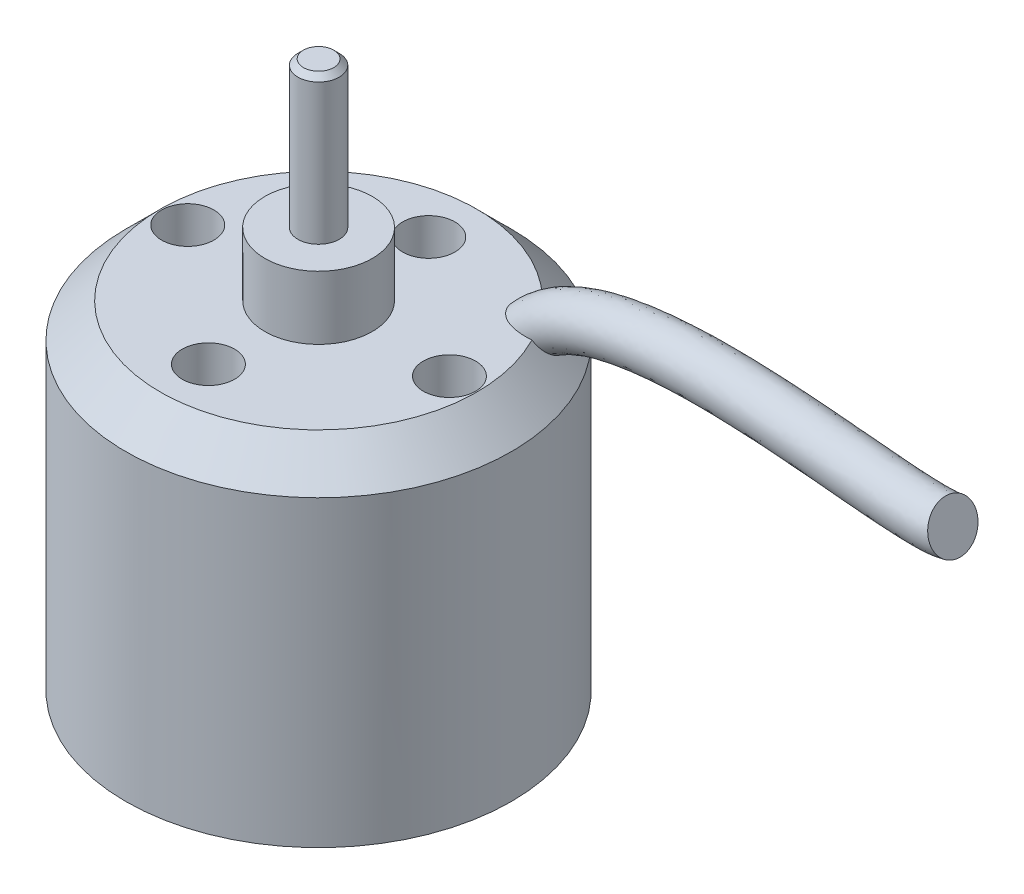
ISO-10303-21;
HEADER;
FILE_DESCRIPTION(('STEP AP214'),'2;1');
FILE_NAME('part.step','',(''),(''),'','','');
FILE_SCHEMA(('AUTOMOTIVE_DESIGN { 1 0 10303 214 1 1 1 1 }'));
ENDSEC;
DATA;
#1=APPLICATION_CONTEXT('core data for automotive mechanical design processes');
#2=APPLICATION_PROTOCOL_DEFINITION('international standard','automotive_design',2000,#1);
#3=PRODUCT_CONTEXT('',#1,'mechanical');
#4=PRODUCT('Part','Part','',(#3));
#5=PRODUCT_RELATED_PRODUCT_CATEGORY('part','',(#4));
#6=PRODUCT_DEFINITION_FORMATION('','',#4);
#7=PRODUCT_DEFINITION_CONTEXT('part definition',#1,'design');
#8=PRODUCT_DEFINITION('design','',#6,#7);
#9=PRODUCT_DEFINITION_SHAPE('','',#8);
#10=(LENGTH_UNIT() NAMED_UNIT(*) SI_UNIT(.MILLI.,.METRE.));
#11=(NAMED_UNIT(*) PLANE_ANGLE_UNIT() SI_UNIT($,.RADIAN.));
#12=(NAMED_UNIT(*) SI_UNIT($,.STERADIAN.) SOLID_ANGLE_UNIT());
#13=UNCERTAINTY_MEASURE_WITH_UNIT(LENGTH_MEASURE(1.E-05),#10,'distance_accuracy_value','');
#14=(GEOMETRIC_REPRESENTATION_CONTEXT(3) GLOBAL_UNCERTAINTY_ASSIGNED_CONTEXT((#13)) GLOBAL_UNIT_ASSIGNED_CONTEXT((#10,
#11,#12)) REPRESENTATION_CONTEXT('',''));
#15=CARTESIAN_POINT('',(0.,0.,0.));
#16=DIRECTION('',(0.,0.,1.));
#17=DIRECTION('',(1.,0.,0.));
#18=AXIS2_PLACEMENT_3D('',#15,#16,#17);
#19=CARTESIAN_POINT('',(0.,27.,0.));
#20=DIRECTION('',(0.,-1.,0.));
#21=DIRECTION('',(1.,0.,0.));
#22=AXIS2_PLACEMENT_3D('',#19,#20,#21);
#23=CONICAL_SURFACE('',#22,14.,0.785398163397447);
#24=CARTESIAN_POINT('',(0.,27.,0.));
#25=DIRECTION('',(0.,1.,0.));
#26=DIRECTION('',(-1.,0.,0.));
#27=AXIS2_PLACEMENT_3D('',#24,#25,#26);
#28=CIRCLE('',#27,14.);
#29=CARTESIAN_POINT('',(-14.,27.,0.));
#30=VERTEX_POINT('',#29);
#31=EDGE_CURVE('E74',#30,#30,#28,.T.);
#32=ORIENTED_EDGE('',*,*,#31,.T.);
#33=EDGE_LOOP('',(#32));
#34=FACE_BOUND('',#33,.T.);
#35=CARTESIAN_POINT('',(10.2216471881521,29.5,-5.26952832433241));
#36=CARTESIAN_POINT('',(10.254055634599,29.4681281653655,-5.27621630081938));
#37=CARTESIAN_POINT('',(10.2858422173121,29.4360112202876,-5.2846293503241));
#38=CARTESIAN_POINT('',(10.3479813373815,29.3714681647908,-5.30490973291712));
#39=CARTESIAN_POINT('',(10.3783335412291,29.3390419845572,-5.31677786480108));
#40=CARTESIAN_POINT('',(10.4669311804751,29.2415932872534,-5.35756541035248));
#41=CARTESIAN_POINT('',(10.5227172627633,29.1764009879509,-5.39166789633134));
#42=CARTESIAN_POINT('',(10.625863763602,29.0474329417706,-5.47311896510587));
#43=CARTESIAN_POINT('',(10.6732084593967,28.9836600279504,-5.52049185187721));
#44=CARTESIAN_POINT('',(10.7576410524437,28.8595143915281,-5.62719451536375));
#45=CARTESIAN_POINT('',(10.7947392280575,28.7991383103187,-5.6865122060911));
#46=CARTESIAN_POINT('',(10.8564687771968,28.6850932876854,-5.81340494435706));
#47=CARTESIAN_POINT('',(10.8814299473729,28.6312807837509,-5.88069125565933));
#48=CARTESIAN_POINT('',(10.9197244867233,28.5296232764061,-6.02268441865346));
#49=CARTESIAN_POINT('',(10.9330543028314,28.4817801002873,-6.09739353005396));
#50=CARTESIAN_POINT('',(10.9479661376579,28.3926017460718,-6.25240938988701));
#51=CARTESIAN_POINT('',(10.9494611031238,28.3513169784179,-6.33275324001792));
#52=CARTESIAN_POINT('',(10.9408725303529,28.2760957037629,-6.49617815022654));
#53=CARTESIAN_POINT('',(10.930786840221,28.2421605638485,-6.57925971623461));
#54=CARTESIAN_POINT('',(10.8985104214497,28.1791199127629,-6.75313379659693));
#55=CARTESIAN_POINT('',(10.8753672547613,28.150666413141,-6.84398370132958));
#56=CARTESIAN_POINT('',(10.8176126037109,28.102143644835,-7.02441256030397));
#57=CARTESIAN_POINT('',(10.7829772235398,28.082092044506,-7.11398845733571));
#58=CARTESIAN_POINT('',(10.6977206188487,28.0476710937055,-7.30297956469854));
#59=CARTESIAN_POINT('',(10.6454969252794,28.0345722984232,-7.40190270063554));
#60=CARTESIAN_POINT('',(10.5296429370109,28.0183875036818,-7.59350815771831));
#61=CARTESIAN_POINT('',(10.466021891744,28.0152934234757,-7.6861954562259));
#62=CARTESIAN_POINT('',(10.3189588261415,28.01895360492,-7.87674650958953));
#63=CARTESIAN_POINT('',(10.2339797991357,28.0272057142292,-7.97340241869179));
#64=CARTESIAN_POINT('',(10.0532371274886,28.0562370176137,-8.1541135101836));
#65=CARTESIAN_POINT('',(9.95746289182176,28.0770286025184,-8.23815612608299));
#66=CARTESIAN_POINT('',(9.75364891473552,28.1326217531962,-8.39356736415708));
#67=CARTESIAN_POINT('',(9.64528157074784,28.167925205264,-8.46433373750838));
#68=CARTESIAN_POINT('',(9.42291955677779,28.2532700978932,-8.58497580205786));
#69=CARTESIAN_POINT('',(9.30893871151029,28.3032767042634,-8.63490020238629));
#70=CARTESIAN_POINT('',(9.11470756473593,28.40103247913,-8.69836795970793));
#71=CARTESIAN_POINT('',(9.03460573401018,28.4449507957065,-8.71833416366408));
#72=CARTESIAN_POINT('',(8.87637867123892,28.5399079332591,-8.74459601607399));
#73=CARTESIAN_POINT('',(8.79825204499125,28.5909415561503,-8.75090158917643));
#74=CARTESIAN_POINT('',(8.64629398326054,28.6996532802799,-8.74888462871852));
#75=CARTESIAN_POINT('',(8.57248679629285,28.7573643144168,-8.74048643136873));
#76=CARTESIAN_POINT('',(8.43254672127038,28.8777945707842,-8.70870603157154));
#77=CARTESIAN_POINT('',(8.36641231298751,28.940512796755,-8.68532680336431));
#78=CARTESIAN_POINT('',(8.24988976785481,29.0631934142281,-8.62711453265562));
#79=CARTESIAN_POINT('',(8.19862306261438,29.1229021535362,-8.59349001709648));
#80=CARTESIAN_POINT('',(8.10603599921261,29.2430978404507,-8.51569024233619));
#81=CARTESIAN_POINT('',(8.06470713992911,29.3035840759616,-8.47152406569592));
#82=CARTESIAN_POINT('',(8.01498612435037,29.3865169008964,-8.40434339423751));
#83=CARTESIAN_POINT('',(8.0020083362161,29.4094016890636,-8.38509719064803));
#84=CARTESIAN_POINT('',(7.97765313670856,29.4549037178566,-8.34543727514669));
#85=CARTESIAN_POINT('',(7.9662721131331,29.4775214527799,-8.32502635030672));
#86=CARTESIAN_POINT('',(7.95567229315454,29.4999999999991,-8.30405192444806));
#87=B_SPLINE_CURVE_WITH_KNOTS('',3,(#35,#36,#37,#38,#39,#40,#41,#42,#43,#44,#45,#46,#47,#48,#49,
#50,#51,#52,#53,#54,#55,#56,#57,#58,#59,#60,#61,#62,#63,#64,#65,#66,#67,#68,#69,#70,#71,#72,#73,
#74,#75,#76,#77,#78,#79,#80,#81,#82,#83,#84,#85,#86),.UNSPECIFIED.,.F.,.F.,(4,2,2,2,2,2,2,2,2,2,
2,2,2,2,2,2,2,2,2,2,2,2,2,2,2,4),(0.,0.137757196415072,0.275546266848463,0.551126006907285,
0.827213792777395,1.10302361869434,1.3708494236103,1.63875701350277,1.90863342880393,
2.1785600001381,2.47133629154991,2.7647252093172,3.10129219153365,3.4375872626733,
3.82279485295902,4.20838370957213,4.60861036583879,5.00789635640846,5.28728883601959,
5.56647826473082,5.8471085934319,6.12768322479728,6.38321575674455,6.63852891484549,
6.73627327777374,6.83379282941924),.UNSPECIFIED.);
#88=CARTESIAN_POINT('',(10.2216471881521,29.5,-5.26952832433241));
#89=VERTEX_POINT('',#88);
#90=CARTESIAN_POINT('',(7.95567229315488,29.5,-8.30405192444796));
#91=VERTEX_POINT('',#90);
#92=EDGE_CURVE('E77',#89,#91,#87,.T.);
#93=ORIENTED_EDGE('',*,*,#92,.F.);
#94=CARTESIAN_POINT('',(0.,29.5,0.));
#95=DIRECTION('',(0.,1.,0.));
#96=DIRECTION('',(-1.,0.,0.));
#97=AXIS2_PLACEMENT_3D('',#94,#95,#96);
#98=CIRCLE('',#97,11.5);
#99=EDGE_CURVE('E69',#91,#89,#98,.T.);
#100=ORIENTED_EDGE('',*,*,#99,.F.);
#101=EDGE_LOOP('',(#93,#100));
#102=FACE_BOUND('',#101,.T.);
#103=ADVANCED_FACE('F50',(#34,#102),#23,.T.);
#104=CARTESIAN_POINT('',(11.5,29.5,0.));
#105=DIRECTION('',(0.,-1.,0.));
#106=DIRECTION('',(1.,0.,0.));
#107=AXIS2_PLACEMENT_3D('',#104,#105,#106);
#108=PLANE('',#107);
#109=CARTESIAN_POINT('',(0.,29.5,0.));
#110=DIRECTION('',(0.,1.,0.));
#111=DIRECTION('',(-1.,0.,0.));
#112=AXIS2_PLACEMENT_3D('',#109,#110,#111);
#113=CIRCLE('',#112,3.9);
#114=CARTESIAN_POINT('',(-3.9,29.5,0.));
#115=VERTEX_POINT('',#114);
#116=EDGE_CURVE('E75',#115,#115,#113,.T.);
#117=ORIENTED_EDGE('',*,*,#116,.F.);
#118=EDGE_LOOP('',(#117));
#119=FACE_BOUND('',#118,.T.);
#120=CARTESIAN_POINT('',(9.5,29.5,0.));
#121=DIRECTION('',(0.,1.,0.));
#122=DIRECTION('',(-1.,0.,0.));
#123=AXIS2_PLACEMENT_3D('',#120,#121,#122);
#124=CIRCLE('',#123,1.9);
#125=CARTESIAN_POINT('',(7.6,29.5,0.));
#126=VERTEX_POINT('',#125);
#127=EDGE_CURVE('E134',#126,#126,#124,.T.);
#128=ORIENTED_EDGE('',*,*,#127,.F.);
#129=EDGE_LOOP('',(#128));
#130=FACE_BOUND('',#129,.T.);
#131=CARTESIAN_POINT('',(-9.5,29.5,0.));
#132=DIRECTION('',(0.,1.,0.));
#133=DIRECTION('',(-1.,0.,0.));
#134=AXIS2_PLACEMENT_3D('',#131,#132,#133);
#135=CIRCLE('',#134,1.9);
#136=CARTESIAN_POINT('',(-11.4,29.5,0.));
#137=VERTEX_POINT('',#136);
#138=EDGE_CURVE('E128',#137,#137,#135,.T.);
#139=ORIENTED_EDGE('',*,*,#138,.F.);
#140=EDGE_LOOP('',(#139));
#141=FACE_BOUND('',#140,.T.);
#142=CARTESIAN_POINT('',(0.,29.5,8.));
#143=DIRECTION('',(0.,1.,0.));
#144=DIRECTION('',(-1.,0.,0.));
#145=AXIS2_PLACEMENT_3D('',#142,#143,#144);
#146=CIRCLE('',#145,1.9);
#147=CARTESIAN_POINT('',(-1.9,29.5,8.));
#148=VERTEX_POINT('',#147);
#149=EDGE_CURVE('E122',#148,#148,#146,.T.);
#150=ORIENTED_EDGE('',*,*,#149,.F.);
#151=EDGE_LOOP('',(#150));
#152=FACE_BOUND('',#151,.T.);
#153=CARTESIAN_POINT('',(0.,29.5,-8.));
#154=DIRECTION('',(0.,1.,0.));
#155=DIRECTION('',(1.,0.,0.));
#156=AXIS2_PLACEMENT_3D('',#153,#154,#155);
#157=CIRCLE('',#156,1.9);
#158=CARTESIAN_POINT('',(1.9,29.5,-8.));
#159=VERTEX_POINT('',#158);
#160=EDGE_CURVE('E79',#159,#159,#157,.T.);
#161=ORIENTED_EDGE('',*,*,#160,.F.);
#162=EDGE_LOOP('',(#161));
#163=FACE_BOUND('',#162,.T.);
#164=CARTESIAN_POINT('',(11.638,29.5,-8.46599852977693));
#165=CARTESIAN_POINT('',(11.574996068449,29.5,-8.48386139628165));
#166=CARTESIAN_POINT('',(11.5117883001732,29.5,-8.50099694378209));
#167=CARTESIAN_POINT('',(11.384982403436,29.5,-8.53377258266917));
#168=CARTESIAN_POINT('',(11.3213842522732,29.5,-8.54941258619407));
#169=CARTESIAN_POINT('',(11.1291649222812,29.5,-8.59422936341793));
#170=CARTESIAN_POINT('',(10.999985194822,29.5,-8.6210561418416));
#171=CARTESIAN_POINT('',(10.7400381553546,29.5,-8.66792682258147));
#172=CARTESIAN_POINT('',(10.6092675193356,29.5,-8.68795237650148));
#173=CARTESIAN_POINT('',(10.3445688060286,29.5,-8.72050408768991));
#174=CARTESIAN_POINT('',(10.2106243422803,29.5,-8.73290029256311));
#175=CARTESIAN_POINT('',(9.94246969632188,29.5,-8.74841012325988));
#176=CARTESIAN_POINT('',(9.80826073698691,29.5,-8.75154400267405));
#177=CARTESIAN_POINT('',(9.54020598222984,29.5,-8.74702728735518));
#178=CARTESIAN_POINT('',(9.40635998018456,29.5,-8.7393970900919));
#179=CARTESIAN_POINT('',(9.20520048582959,29.5,-8.71832393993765));
#180=CARTESIAN_POINT('',(9.13738729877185,29.5,-8.70955400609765));
#181=CARTESIAN_POINT('',(9.00231903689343,29.5,-8.6884323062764));
#182=CARTESIAN_POINT('',(8.93506400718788,29.5,-8.67608025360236));
#183=CARTESIAN_POINT('',(8.73477090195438,29.5,-8.63325111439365));
#184=CARTESIAN_POINT('',(8.60288844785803,29.4999999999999,-8.59697088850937));
#185=CARTESIAN_POINT('',(8.34389905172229,29.5000000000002,-8.50592981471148));
#186=CARTESIAN_POINT('',(8.21686070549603,29.5000000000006,-8.45096982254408));
#187=CARTESIAN_POINT('',(7.97391600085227,29.4999999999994,-8.32015874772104));
#188=CARTESIAN_POINT('',(7.85798850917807,29.4999999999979,-8.2443484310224));
#189=CARTESIAN_POINT('',(7.67911440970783,29.4999999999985,-8.09883224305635));
#190=CARTESIAN_POINT('',(7.61122386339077,29.4999999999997,-8.03520753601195));
#191=CARTESIAN_POINT('',(7.48633949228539,29.5000000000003,-7.89793014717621));
#192=CARTESIAN_POINT('',(7.42934177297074,29.4999999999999,-7.82428106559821));
#193=CARTESIAN_POINT('',(7.32886127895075,29.4999999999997,-7.6671684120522));
#194=CARTESIAN_POINT('',(7.28551204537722,29.4999999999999,-7.58361824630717));
#195=CARTESIAN_POINT('',(7.21624236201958,29.5000000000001,-7.40956415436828));
#196=CARTESIAN_POINT('',(7.19030161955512,29.5,-7.31906846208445));
#197=CARTESIAN_POINT('',(7.16032412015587,29.5,-7.14785770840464));
#198=CARTESIAN_POINT('',(7.15368678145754,29.5,-7.06759320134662));
#199=CARTESIAN_POINT('',(7.15523805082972,29.5,-6.90721984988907));
#200=CARTESIAN_POINT('',(7.16342106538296,29.5,-6.82711095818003));
#201=CARTESIAN_POINT('',(7.19283412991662,29.5,-6.67586147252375));
#202=CARTESIAN_POINT('',(7.21299704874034,29.5,-6.60450865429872));
#203=CARTESIAN_POINT('',(7.26432307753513,29.5,-6.46590898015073));
#204=CARTESIAN_POINT('',(7.29548679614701,29.5,-6.39866235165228));
#205=CARTESIAN_POINT('',(7.36961961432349,29.5,-6.26546017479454));
#206=CARTESIAN_POINT('',(7.41320738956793,29.5,-6.19985116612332));
#207=CARTESIAN_POINT('',(7.50926842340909,29.5,-6.07553091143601));
#208=CARTESIAN_POINT('',(7.56174721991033,29.5,-6.01682400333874));
#209=CARTESIAN_POINT('',(7.70080102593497,29.5,-5.88012943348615));
#210=CARTESIAN_POINT('',(7.79163148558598,29.5,-5.80645766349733));
#211=CARTESIAN_POINT('',(7.98396175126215,29.5,-5.67472341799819));
#212=CARTESIAN_POINT('',(8.08548292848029,29.5,-5.6166930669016));
#213=CARTESIAN_POINT('',(8.34126095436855,29.5,-5.49292833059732));
#214=CARTESIAN_POINT('',(8.49921015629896,29.5,-5.43486827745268));
#215=CARTESIAN_POINT('',(8.82211512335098,29.5,-5.34399354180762));
#216=CARTESIAN_POINT('',(8.98708373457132,29.5,-5.31122744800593));
#217=CARTESIAN_POINT('',(9.2907973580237,29.5,-5.2703880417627));
#218=CARTESIAN_POINT('',(9.42913138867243,29.5,-5.25901907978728));
#219=CARTESIAN_POINT('',(9.70632238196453,29.5,-5.2483007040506));
#220=CARTESIAN_POINT('',(9.84517965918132,29.5,-5.24896031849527));
#221=CARTESIAN_POINT('',(10.12273287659,29.5,-5.2605088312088));
#222=CARTESIAN_POINT('',(10.2614277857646,29.5,-5.27142028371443));
#223=CARTESIAN_POINT('',(10.5377644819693,29.5,-5.30205332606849));
#224=CARTESIAN_POINT('',(10.6754066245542,29.5,-5.3217717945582));
#225=CARTESIAN_POINT('',(10.9520156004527,29.5,-5.3693908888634));
#226=CARTESIAN_POINT('',(11.0909561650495,29.5,-5.3974431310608));
#227=CARTESIAN_POINT('',(11.2976455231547,29.5,-5.44484579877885));
#228=CARTESIAN_POINT('',(11.3660330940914,29.5,-5.46147079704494));
#229=CARTESIAN_POINT('',(11.502358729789,29.5,-5.49645143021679));
#230=CARTESIAN_POINT('',(11.570296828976,29.5,-5.51480693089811));
#231=CARTESIAN_POINT('',(11.638,29.5,-5.53400147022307));
#232=B_SPLINE_CURVE_WITH_KNOTS('',3,(#164,#165,#166,#167,#168,#169,#170,#171,#172,#173,#174,
#175,#176,#177,#178,#179,#180,#181,#182,#183,#184,#185,#186,#187,#188,#189,#190,#191,#192,#193,
#194,#195,#196,#197,#198,#199,#200,#201,#202,#203,#204,#205,#206,#207,#208,#209,#210,#211,#212,
#213,#214,#215,#216,#217,#218,#219,#220,#221,#222,#223,#224,#225,#226,#227,#228,#229,#230,#231),
.UNSPECIFIED.,.F.,.F.,(4,2,2,2,2,2,2,2,2,2,2,2,2,2,2,2,2,2,2,2,2,2,2,2,2,2,2,2,2,2,2,2,2,4),(0.,
0.196452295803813,0.392916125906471,0.788543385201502,1.18522964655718,1.5884981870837,
1.99088426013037,2.39250885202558,2.59755629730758,2.8026201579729,3.21179964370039,
3.62548582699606,4.03836886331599,4.3165149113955,4.59456132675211,4.87524928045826,
5.15560947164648,5.39590188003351,5.63610361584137,5.85757503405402,6.07905870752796,
6.31445723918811,6.55000293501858,6.89889324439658,7.2484947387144,7.75053840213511,
8.25354408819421,8.6693618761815,9.08549177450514,9.50253931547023,9.91943916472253,
10.3444439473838,10.5555631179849,10.7666659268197),.UNSPECIFIED.);
#233=EDGE_CURVE('E12',#91,#89,#232,.T.);
#234=ORIENTED_EDGE('',*,*,#233,.F.);
#235=ORIENTED_EDGE('',*,*,#99,.T.);
#236=EDGE_LOOP('',(#234,#235));
#237=FACE_BOUND('',#236,.T.);
#238=ADVANCED_FACE('F71',(#119,#130,#141,#152,#163,#237),#108,.F.);
#239=CARTESIAN_POINT('',(0.,44.3,0.));
#240=DIRECTION('',(0.,-1.,0.));
#241=DIRECTION('',(1.,0.,0.));
#242=AXIS2_PLACEMENT_3D('',#239,#240,#241);
#243=CONICAL_SURFACE('',#242,1.50000000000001,0.785398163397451);
#244=CARTESIAN_POINT('',(0.,44.7,0.));
#245=DIRECTION('',(0.,1.,0.));
#246=DIRECTION('',(-1.,0.,0.));
#247=AXIS2_PLACEMENT_3D('',#244,#245,#246);
#248=CIRCLE('',#247,1.10000000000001);
#249=CARTESIAN_POINT('',(-1.1,44.7,0.));
#250=VERTEX_POINT('',#249);
#251=EDGE_CURVE('E63',#250,#250,#248,.T.);
#252=ORIENTED_EDGE('',*,*,#251,.F.);
#253=EDGE_LOOP('',(#252));
#254=FACE_BOUND('',#253,.T.);
#255=CARTESIAN_POINT('',(0.,44.3,0.));
#256=DIRECTION('',(0.,1.,0.));
#257=DIRECTION('',(-1.,0.,0.));
#258=AXIS2_PLACEMENT_3D('',#255,#256,#257);
#259=CIRCLE('',#258,1.50000000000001);
#260=CARTESIAN_POINT('',(-1.5,44.3,0.));
#261=VERTEX_POINT('',#260);
#262=EDGE_CURVE('E140',#261,#261,#259,.T.);
#263=ORIENTED_EDGE('',*,*,#262,.T.);
#264=EDGE_LOOP('',(#263));
#265=FACE_BOUND('',#264,.T.);
#266=ADVANCED_FACE('F52',(#254,#265),#243,.T.);
#267=CARTESIAN_POINT('',(1.10000000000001,44.7,0.));
#268=DIRECTION('',(0.,-1.,0.));
#269=DIRECTION('',(1.,0.,0.));
#270=AXIS2_PLACEMENT_3D('',#267,#268,#269);
#271=PLANE('',#270);
#272=ORIENTED_EDGE('',*,*,#251,.T.);
#273=EDGE_LOOP('',(#272));
#274=FACE_BOUND('',#273,.T.);
#275=ADVANCED_FACE('F171',(#274),#271,.F.);
#276=CARTESIAN_POINT('',(1.50000000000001,0.,0.));
#277=DIRECTION('',(0.,1.,0.));
#278=DIRECTION('',(-1.,0.,0.));
#279=AXIS2_PLACEMENT_3D('',#276,#277,#278);
#280=PLANE('',#279);
#281=CARTESIAN_POINT('',(0.,0.,0.));
#282=DIRECTION('',(0.,1.,0.));
#283=DIRECTION('',(-1.,0.,0.));
#284=AXIS2_PLACEMENT_3D('',#281,#282,#283);
#285=CIRCLE('',#284,1.50000000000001);
#286=CARTESIAN_POINT('',(-1.50000000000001,0.,0.));
#287=VERTEX_POINT('',#286);
#288=EDGE_CURVE('E166',#287,#287,#285,.T.);
#289=ORIENTED_EDGE('',*,*,#288,.F.);
#290=EDGE_LOOP('',(#289));
#291=FACE_BOUND('',#290,.T.);
#292=ADVANCED_FACE('F361',(#291),#280,.F.);
#293=CARTESIAN_POINT('',(0.,44.7,0.));
#294=DIRECTION('',(0.,1.,0.));
#295=DIRECTION('',(-1.,0.,0.));
#296=AXIS2_PLACEMENT_3D('',#293,#294,#295);
#297=CYLINDRICAL_SURFACE('',#296,1.50000000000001);
#298=CARTESIAN_POINT('',(0.,0.399999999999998,0.));
#299=DIRECTION('',(0.,1.,0.));
#300=DIRECTION('',(-1.,0.,0.));
#301=AXIS2_PLACEMENT_3D('',#298,#299,#300);
#302=CIRCLE('',#301,1.50000000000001);
#303=CARTESIAN_POINT('',(-1.5,0.399999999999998,0.));
#304=VERTEX_POINT('',#303);
#305=EDGE_CURVE('E163',#304,#304,#302,.T.);
#306=ORIENTED_EDGE('',*,*,#305,.F.);
#307=EDGE_LOOP('',(#306));
#308=FACE_BOUND('',#307,.T.);
#309=ORIENTED_EDGE('',*,*,#288,.T.);
#310=EDGE_LOOP('',(#309));
#311=FACE_BOUND('',#310,.T.);
#312=ADVANCED_FACE('F351',(#308,#311),#297,.T.);
#313=CARTESIAN_POINT('',(4.00000000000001,0.4,0.));
#314=DIRECTION('',(0.,1.,0.));
#315=DIRECTION('',(-1.,0.,0.));
#316=AXIS2_PLACEMENT_3D('',#313,#314,#315);
#317=PLANE('',#316);
#318=CARTESIAN_POINT('',(0.,0.399999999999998,0.));
#319=DIRECTION('',(0.,1.,0.));
#320=DIRECTION('',(-1.,0.,0.));
#321=AXIS2_PLACEMENT_3D('',#318,#319,#320);
#322=CIRCLE('',#321,4.00000000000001);
#323=CARTESIAN_POINT('',(-4.00000000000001,0.399999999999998,0.));
#324=VERTEX_POINT('',#323);
#325=EDGE_CURVE('E160',#324,#324,#322,.T.);
#326=ORIENTED_EDGE('',*,*,#325,.F.);
#327=EDGE_LOOP('',(#326));
#328=FACE_BOUND('',#327,.T.);
#329=ORIENTED_EDGE('',*,*,#305,.T.);
#330=EDGE_LOOP('',(#329));
#331=FACE_BOUND('',#330,.T.);
#332=ADVANCED_FACE('F343',(#328,#331),#317,.F.);
#333=CARTESIAN_POINT('',(0.,44.7,0.));
#334=DIRECTION('',(0.,1.,0.));
#335=DIRECTION('',(-1.,0.,0.));
#336=AXIS2_PLACEMENT_3D('',#333,#334,#335);
#337=CYLINDRICAL_SURFACE('',#336,4.00000000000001);
#338=CARTESIAN_POINT('',(0.,5.,0.));
#339=DIRECTION('',(0.,1.,0.));
#340=DIRECTION('',(-1.,0.,0.));
#341=AXIS2_PLACEMENT_3D('',#338,#339,#340);
#342=CIRCLE('',#341,4.00000000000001);
#343=CARTESIAN_POINT('',(-4.00000000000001,5.,0.));
#344=VERTEX_POINT('',#343);
#345=EDGE_CURVE('E157',#344,#344,#342,.T.);
#346=ORIENTED_EDGE('',*,*,#345,.F.);
#347=EDGE_LOOP('',(#346));
#348=FACE_BOUND('',#347,.T.);
#349=ORIENTED_EDGE('',*,*,#325,.T.);
#350=EDGE_LOOP('',(#349));
#351=FACE_BOUND('',#350,.T.);
#352=ADVANCED_FACE('F288',(#348,#351),#337,.T.);
#353=CARTESIAN_POINT('',(4.00000000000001,5.,0.));
#354=DIRECTION('',(0.,1.,0.));
#355=DIRECTION('',(-1.,0.,0.));
#356=AXIS2_PLACEMENT_3D('',#353,#354,#355);
#357=PLANE('',#356);
#358=ORIENTED_EDGE('',*,*,#345,.T.);
#359=EDGE_LOOP('',(#358));
#360=FACE_BOUND('',#359,.T.);
#361=CARTESIAN_POINT('',(0.,5.,0.));
#362=DIRECTION('',(0.,1.,0.));
#363=DIRECTION('',(-1.,0.,0.));
#364=AXIS2_PLACEMENT_3D('',#361,#362,#363);
#365=CIRCLE('',#364,14.);
#366=CARTESIAN_POINT('',(-14.,5.,0.));
#367=VERTEX_POINT('',#366);
#368=EDGE_CURVE('E154',#367,#367,#365,.T.);
#369=ORIENTED_EDGE('',*,*,#368,.F.);
#370=EDGE_LOOP('',(#369));
#371=FACE_BOUND('',#370,.T.);
#372=ADVANCED_FACE('F284',(#360,#371),#357,.F.);
#373=CARTESIAN_POINT('',(0.,44.7,0.));
#374=DIRECTION('',(0.,1.,0.));
#375=DIRECTION('',(-1.,0.,0.));
#376=AXIS2_PLACEMENT_3D('',#373,#374,#375);
#377=CYLINDRICAL_SURFACE('',#376,14.);
#378=ORIENTED_EDGE('',*,*,#31,.F.);
#379=EDGE_LOOP('',(#378));
#380=FACE_BOUND('',#379,.T.);
#381=ORIENTED_EDGE('',*,*,#368,.T.);
#382=EDGE_LOOP('',(#381));
#383=FACE_BOUND('',#382,.T.);
#384=ADVANCED_FACE('F112',(#380,#383),#377,.T.);
#385=CARTESIAN_POINT('',(0.,44.7,0.));
#386=DIRECTION('',(0.,1.,0.));
#387=DIRECTION('',(-1.,0.,0.));
#388=AXIS2_PLACEMENT_3D('',#385,#386,#387);
#389=CYLINDRICAL_SURFACE('',#388,3.9);
#390=CARTESIAN_POINT('',(0.,34.1,0.));
#391=DIRECTION('',(0.,1.,0.));
#392=DIRECTION('',(-1.,0.,0.));
#393=AXIS2_PLACEMENT_3D('',#390,#391,#392);
#394=CIRCLE('',#393,3.9);
#395=CARTESIAN_POINT('',(-3.9,34.1,0.));
#396=VERTEX_POINT('',#395);
#397=EDGE_CURVE('E148',#396,#396,#394,.T.);
#398=ORIENTED_EDGE('',*,*,#397,.F.);
#399=EDGE_LOOP('',(#398));
#400=FACE_BOUND('',#399,.T.);
#401=ORIENTED_EDGE('',*,*,#116,.T.);
#402=EDGE_LOOP('',(#401));
#403=FACE_BOUND('',#402,.T.);
#404=ADVANCED_FACE('F187',(#400,#403),#389,.T.);
#405=CARTESIAN_POINT('',(3.9,34.1,0.));
#406=DIRECTION('',(0.,-1.,0.));
#407=DIRECTION('',(1.,0.,0.));
#408=AXIS2_PLACEMENT_3D('',#405,#406,#407);
#409=PLANE('',#408);
#410=CARTESIAN_POINT('',(0.,34.1,0.));
#411=DIRECTION('',(0.,1.,0.));
#412=DIRECTION('',(-1.,0.,0.));
#413=AXIS2_PLACEMENT_3D('',#410,#411,#412);
#414=CIRCLE('',#413,1.50000000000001);
#415=CARTESIAN_POINT('',(-1.5,34.1,0.));
#416=VERTEX_POINT('',#415);
#417=EDGE_CURVE('E145',#416,#416,#414,.T.);
#418=ORIENTED_EDGE('',*,*,#417,.F.);
#419=EDGE_LOOP('',(#418));
#420=FACE_BOUND('',#419,.T.);
#421=ORIENTED_EDGE('',*,*,#397,.T.);
#422=EDGE_LOOP('',(#421));
#423=FACE_BOUND('',#422,.T.);
#424=ADVANCED_FACE('F181',(#420,#423),#409,.F.);
#425=CARTESIAN_POINT('',(0.,44.7,0.));
#426=DIRECTION('',(0.,1.,0.));
#427=DIRECTION('',(-1.,0.,0.));
#428=AXIS2_PLACEMENT_3D('',#425,#426,#427);
#429=CYLINDRICAL_SURFACE('',#428,1.50000000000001);
#430=ORIENTED_EDGE('',*,*,#262,.F.);
#431=EDGE_LOOP('',(#430));
#432=FACE_BOUND('',#431,.T.);
#433=ORIENTED_EDGE('',*,*,#417,.T.);
#434=EDGE_LOOP('',(#433));
#435=FACE_BOUND('',#434,.T.);
#436=ADVANCED_FACE('F177',(#432,#435),#429,.T.);
#437=CARTESIAN_POINT('',(9.5,19.5,0.));
#438=DIRECTION('',(0.,1.,0.));
#439=DIRECTION('',(-1.,0.,0.));
#440=AXIS2_PLACEMENT_3D('',#437,#438,#439);
#441=CYLINDRICAL_SURFACE('',#440,1.9);
#442=CARTESIAN_POINT('',(9.5,19.5,0.));
#443=DIRECTION('',(0.,1.,0.));
#444=DIRECTION('',(-1.,0.,0.));
#445=AXIS2_PLACEMENT_3D('',#442,#443,#444);
#446=CIRCLE('',#445,1.9);
#447=CARTESIAN_POINT('',(7.6,19.5,0.));
#448=VERTEX_POINT('',#447);
#449=EDGE_CURVE('E137',#448,#448,#446,.T.);
#450=ORIENTED_EDGE('',*,*,#449,.F.);
#451=EDGE_LOOP('',(#450));
#452=FACE_BOUND('',#451,.T.);
#453=ORIENTED_EDGE('',*,*,#127,.T.);
#454=EDGE_LOOP('',(#453));
#455=FACE_BOUND('',#454,.T.);
#456=ADVANCED_FACE('F180',(#452,#455),#441,.F.);
#457=CARTESIAN_POINT('',(9.5,19.5,0.));
#458=DIRECTION('',(0.,1.,0.));
#459=DIRECTION('',(-1.,0.,0.));
#460=AXIS2_PLACEMENT_3D('',#457,#458,#459);
#461=PLANE('',#460);
#462=ORIENTED_EDGE('',*,*,#449,.T.);
#463=EDGE_LOOP('',(#462));
#464=FACE_BOUND('',#463,.T.);
#465=ADVANCED_FACE('F225',(#464),#461,.T.);
#466=CARTESIAN_POINT('',(-9.5,19.5,0.));
#467=DIRECTION('',(0.,1.,0.));
#468=DIRECTION('',(-1.,0.,0.));
#469=AXIS2_PLACEMENT_3D('',#466,#467,#468);
#470=CYLINDRICAL_SURFACE('',#469,1.9);
#471=CARTESIAN_POINT('',(-9.5,19.5,0.));
#472=DIRECTION('',(0.,1.,0.));
#473=DIRECTION('',(-1.,0.,0.));
#474=AXIS2_PLACEMENT_3D('',#471,#472,#473);
#475=CIRCLE('',#474,1.9);
#476=CARTESIAN_POINT('',(-11.4,19.5,0.));
#477=VERTEX_POINT('',#476);
#478=EDGE_CURVE('E131',#477,#477,#475,.T.);
#479=ORIENTED_EDGE('',*,*,#478,.F.);
#480=EDGE_LOOP('',(#479));
#481=FACE_BOUND('',#480,.T.);
#482=ORIENTED_EDGE('',*,*,#138,.T.);
#483=EDGE_LOOP('',(#482));
#484=FACE_BOUND('',#483,.T.);
#485=ADVANCED_FACE('F221',(#481,#484),#470,.F.);
#486=CARTESIAN_POINT('',(-9.5,19.5,0.));
#487=DIRECTION('',(0.,1.,0.));
#488=DIRECTION('',(-1.,0.,0.));
#489=AXIS2_PLACEMENT_3D('',#486,#487,#488);
#490=PLANE('',#489);
#491=ORIENTED_EDGE('',*,*,#478,.T.);
#492=EDGE_LOOP('',(#491));
#493=FACE_BOUND('',#492,.T.);
#494=ADVANCED_FACE('F217',(#493),#490,.T.);
#495=CARTESIAN_POINT('',(0.,19.5,8.));
#496=DIRECTION('',(0.,1.,0.));
#497=DIRECTION('',(-1.,0.,0.));
#498=AXIS2_PLACEMENT_3D('',#495,#496,#497);
#499=CYLINDRICAL_SURFACE('',#498,1.9);
#500=CARTESIAN_POINT('',(0.,19.5,8.));
#501=DIRECTION('',(0.,1.,0.));
#502=DIRECTION('',(-1.,0.,0.));
#503=AXIS2_PLACEMENT_3D('',#500,#501,#502);
#504=CIRCLE('',#503,1.9);
#505=CARTESIAN_POINT('',(-1.9,19.5,8.));
#506=VERTEX_POINT('',#505);
#507=EDGE_CURVE('E125',#506,#506,#504,.T.);
#508=ORIENTED_EDGE('',*,*,#507,.F.);
#509=EDGE_LOOP('',(#508));
#510=FACE_BOUND('',#509,.T.);
#511=ORIENTED_EDGE('',*,*,#149,.T.);
#512=EDGE_LOOP('',(#511));
#513=FACE_BOUND('',#512,.T.);
#514=ADVANCED_FACE('F210',(#510,#513),#499,.F.);
#515=CARTESIAN_POINT('',(0.,19.5,8.));
#516=DIRECTION('',(0.,1.,0.));
#517=DIRECTION('',(-1.,0.,0.));
#518=AXIS2_PLACEMENT_3D('',#515,#516,#517);
#519=PLANE('',#518);
#520=ORIENTED_EDGE('',*,*,#507,.T.);
#521=EDGE_LOOP('',(#520));
#522=FACE_BOUND('',#521,.T.);
#523=ADVANCED_FACE('F204',(#522),#519,.T.);
#524=CARTESIAN_POINT('',(0.,19.5,-8.));
#525=DIRECTION('',(0.,1.,0.));
#526=DIRECTION('',(-1.,0.,0.));
#527=AXIS2_PLACEMENT_3D('',#524,#525,#526);
#528=CYLINDRICAL_SURFACE('',#527,1.9);
#529=CARTESIAN_POINT('',(0.,19.5,-8.));
#530=DIRECTION('',(0.,1.,0.));
#531=DIRECTION('',(1.,0.,0.));
#532=AXIS2_PLACEMENT_3D('',#529,#530,#531);
#533=CIRCLE('',#532,1.9);
#534=CARTESIAN_POINT('',(1.9,19.5,-8.));
#535=VERTEX_POINT('',#534);
#536=EDGE_CURVE('E119',#535,#535,#533,.T.);
#537=ORIENTED_EDGE('',*,*,#536,.F.);
#538=EDGE_LOOP('',(#537));
#539=FACE_BOUND('',#538,.T.);
#540=ORIENTED_EDGE('',*,*,#160,.T.);
#541=EDGE_LOOP('',(#540));
#542=FACE_BOUND('',#541,.T.);
#543=ADVANCED_FACE('F93',(#539,#542),#528,.F.);
#544=CARTESIAN_POINT('',(0.,19.5,-8.));
#545=DIRECTION('',(0.,-1.,0.));
#546=DIRECTION('',(1.,0.,0.));
#547=AXIS2_PLACEMENT_3D('',#544,#545,#546);
#548=PLANE('',#547);
#549=ORIENTED_EDGE('',*,*,#536,.T.);
#550=EDGE_LOOP('',(#549));
#551=FACE_BOUND('',#550,.T.);
#552=ADVANCED_FACE('F85',(#551),#548,.F.);
#553=CARTESIAN_POINT('',(8.75,5.,-7.));
#554=CARTESIAN_POINT('',(8.77000697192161,6.7079540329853,-7.));
#555=CARTESIAN_POINT('',(8.22288168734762,11.2921410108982,-7.));
#556=CARTESIAN_POINT('',(7.53899812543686,17.7743675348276,-7.));
#557=CARTESIAN_POINT('',(7.79102132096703,22.4921580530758,-7.));
#558=CARTESIAN_POINT('',(8.44997033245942,25.1148060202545,-7.));
#559=CARTESIAN_POINT('',(9.22227208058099,26.5092373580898,-7.));
#560=CARTESIAN_POINT('',(9.88527971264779,27.3363139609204,-7.));
#561=CARTESIAN_POINT('',(10.6636225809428,28.0523561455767,-7.));
#562=CARTESIAN_POINT('',(12.6627411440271,29.259382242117,-7.));
#563=CARTESIAN_POINT('',(16.6609534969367,30.2690566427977,-7.));
#564=CARTESIAN_POINT('',(22.6890442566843,30.4706007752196,-7.));
#565=CARTESIAN_POINT('',(29.5698641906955,30.0117303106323,-6.99999999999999));
#566=CARTESIAN_POINT('',(34.3957713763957,29.4888516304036,-7.));
#567=CARTESIAN_POINT('',(37.1858200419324,29.3877167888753,-7.));
#568=CARTESIAN_POINT('',(38.4175403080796,29.4090778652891,-6.99999999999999));
#569=CARTESIAN_POINT('',(39.2230877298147,29.5549458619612,-7.));
#570=CARTESIAN_POINT('',(39.5727058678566,29.6483864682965,-7.));
#571=CARTESIAN_POINT('',(8.75,5.,-3.5));
#572=CARTESIAN_POINT('',(8.77000697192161,6.7079540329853,-3.5));
#573=CARTESIAN_POINT('',(8.22288168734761,11.2921410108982,-3.5));
#574=CARTESIAN_POINT('',(7.53899812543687,17.7743675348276,-3.5));
#575=CARTESIAN_POINT('',(7.79102132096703,22.4921580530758,-3.5));
#576=CARTESIAN_POINT('',(8.44997033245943,25.1148060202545,-3.5));
#577=CARTESIAN_POINT('',(9.22227208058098,26.5092373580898,-3.5));
#578=CARTESIAN_POINT('',(9.88527971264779,27.3363139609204,-3.5));
#579=CARTESIAN_POINT('',(10.6636225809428,28.0523561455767,-3.5));
#580=CARTESIAN_POINT('',(12.6627411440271,29.259382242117,-3.5));
#581=CARTESIAN_POINT('',(16.6609534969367,30.2690566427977,-3.5));
#582=CARTESIAN_POINT('',(22.6890442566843,30.4706007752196,-3.50000000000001));
#583=CARTESIAN_POINT('',(29.5698641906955,30.0117303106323,-3.49999999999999));
#584=CARTESIAN_POINT('',(34.3957713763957,29.4888516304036,-3.5));
#585=CARTESIAN_POINT('',(37.1858200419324,29.3877167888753,-3.5));
#586=CARTESIAN_POINT('',(38.4175403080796,29.4090778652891,-3.5));
#587=CARTESIAN_POINT('',(39.2230877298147,29.5549458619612,-3.5));
#588=CARTESIAN_POINT('',(39.5727058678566,29.6483864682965,-3.5));
#589=CARTESIAN_POINT('',(5.25,5.,-3.5));
#590=CARTESIAN_POINT('',(5.28617292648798,6.49581392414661,-3.5));
#591=CARTESIAN_POINT('',(4.77137955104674,10.6557206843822,-3.5));
#592=CARTESIAN_POINT('',(4.03377983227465,17.5158187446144,-3.5));
#593=CARTESIAN_POINT('',(4.29308575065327,22.8617000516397,-3.5));
#594=CARTESIAN_POINT('',(5.08657796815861,26.2197470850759,-3.5));
#595=CARTESIAN_POINT('',(6.2142426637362,28.3458137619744,-3.5));
#596=CARTESIAN_POINT('',(7.28209317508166,29.6870304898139,-3.5));
#597=CARTESIAN_POINT('',(8.53860658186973,30.8745871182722,-3.5));
#598=CARTESIAN_POINT('',(11.4201435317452,32.5925472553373,-3.50000000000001));
#599=CARTESIAN_POINT('',(16.2268344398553,33.7601726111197,-3.5));
#600=CARTESIAN_POINT('',(22.7317321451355,33.9757490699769,-3.5));
#601=CARTESIAN_POINT('',(29.8452409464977,33.4982201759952,-3.5));
#602=CARTESIAN_POINT('',(34.6985428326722,32.9871495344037,-3.5));
#603=CARTESIAN_POINT('',(37.1718708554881,32.8847165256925,-3.50000000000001));
#604=CARTESIAN_POINT('',(38.1503547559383,32.9226920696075,-3.5));
#605=CARTESIAN_POINT('',(38.4377463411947,32.9531753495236,-3.50000000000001));
#606=CARTESIAN_POINT('',(38.5282865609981,32.9889235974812,-3.50000000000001));
#607=CARTESIAN_POINT('',(5.25,5.,-7.));
#608=CARTESIAN_POINT('',(5.28617292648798,6.49581392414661,-7.));
#609=CARTESIAN_POINT('',(4.77137955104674,10.6557206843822,-7.));
#610=CARTESIAN_POINT('',(4.03377983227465,17.5158187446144,-7.));
#611=CARTESIAN_POINT('',(4.29308575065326,22.8617000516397,-7.));
#612=CARTESIAN_POINT('',(5.08657796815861,26.2197470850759,-7.));
#613=CARTESIAN_POINT('',(6.2142426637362,28.3458137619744,-7.));
#614=CARTESIAN_POINT('',(7.28209317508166,29.6870304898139,-7.));
#615=CARTESIAN_POINT('',(8.53860658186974,30.8745871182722,-7.));
#616=CARTESIAN_POINT('',(11.4201435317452,32.5925472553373,-7.));
#617=CARTESIAN_POINT('',(16.2268344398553,33.7601726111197,-7.));
#618=CARTESIAN_POINT('',(22.7317321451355,33.9757490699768,-7.));
#619=CARTESIAN_POINT('',(29.8452409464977,33.4982201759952,-7.00000000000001));
#620=CARTESIAN_POINT('',(34.6985428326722,32.9871495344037,-7.));
#621=CARTESIAN_POINT('',(37.1718708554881,32.8847165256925,-7.00000000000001));
#622=CARTESIAN_POINT('',(38.1503547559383,32.9226920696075,-7.));
#623=CARTESIAN_POINT('',(38.4377463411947,32.9531753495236,-7.));
#624=CARTESIAN_POINT('',(38.5282865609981,32.9889235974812,-7.));
#625=CARTESIAN_POINT('',(5.25,5.,-10.5));
#626=CARTESIAN_POINT('',(5.28617292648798,6.49581392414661,-10.5));
#627=CARTESIAN_POINT('',(4.77137955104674,10.6557206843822,-10.5));
#628=CARTESIAN_POINT('',(4.03377983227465,17.5158187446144,-10.5));
#629=CARTESIAN_POINT('',(4.29308575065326,22.8617000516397,-10.5));
#630=CARTESIAN_POINT('',(5.08657796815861,26.2197470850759,-10.5));
#631=CARTESIAN_POINT('',(6.2142426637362,28.3458137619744,-10.5));
#632=CARTESIAN_POINT('',(7.28209317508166,29.6870304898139,-10.5));
#633=CARTESIAN_POINT('',(8.53860658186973,30.8745871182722,-10.5));
#634=CARTESIAN_POINT('',(11.4201435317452,32.5925472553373,-10.5));
#635=CARTESIAN_POINT('',(16.2268344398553,33.7601726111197,-10.5));
#636=CARTESIAN_POINT('',(22.7317321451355,33.9757490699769,-10.5));
#637=CARTESIAN_POINT('',(29.8452409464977,33.4982201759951,-10.5));
#638=CARTESIAN_POINT('',(34.6985428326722,32.9871495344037,-10.5));
#639=CARTESIAN_POINT('',(37.1718708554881,32.8847165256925,-10.5));
#640=CARTESIAN_POINT('',(38.1503547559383,32.9226920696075,-10.5));
#641=CARTESIAN_POINT('',(38.4377463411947,32.9531753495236,-10.5));
#642=CARTESIAN_POINT('',(38.5282865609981,32.9889235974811,-10.5));
#643=CARTESIAN_POINT('',(8.75,5.,-10.5));
#644=CARTESIAN_POINT('',(8.77000697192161,6.7079540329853,-10.5));
#645=CARTESIAN_POINT('',(8.22288168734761,11.2921410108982,-10.5));
#646=CARTESIAN_POINT('',(7.53899812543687,17.7743675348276,-10.5));
#647=CARTESIAN_POINT('',(7.79102132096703,22.4921580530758,-10.5));
#648=CARTESIAN_POINT('',(8.44997033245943,25.1148060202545,-10.5));
#649=CARTESIAN_POINT('',(9.22227208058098,26.5092373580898,-10.5));
#650=CARTESIAN_POINT('',(9.88527971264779,27.3363139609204,-10.5));
#651=CARTESIAN_POINT('',(10.6636225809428,28.0523561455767,-10.5));
#652=CARTESIAN_POINT('',(12.6627411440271,29.259382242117,-10.5));
#653=CARTESIAN_POINT('',(16.6609534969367,30.2690566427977,-10.5));
#654=CARTESIAN_POINT('',(22.6890442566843,30.4706007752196,-10.5));
#655=CARTESIAN_POINT('',(29.5698641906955,30.0117303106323,-10.5));
#656=CARTESIAN_POINT('',(34.3957713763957,29.4888516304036,-10.5));
#657=CARTESIAN_POINT('',(37.1858200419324,29.3877167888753,-10.5));
#658=CARTESIAN_POINT('',(38.4175403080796,29.4090778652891,-10.5));
#659=CARTESIAN_POINT('',(39.2230877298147,29.5549458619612,-10.5));
#660=CARTESIAN_POINT('',(39.5727058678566,29.6483864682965,-10.5));
#661=CARTESIAN_POINT('',(8.75,5.,-7.));
#662=CARTESIAN_POINT('',(8.77000697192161,6.7079540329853,-7.));
#663=CARTESIAN_POINT('',(8.22288168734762,11.2921410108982,-7.));
#664=CARTESIAN_POINT('',(7.53899812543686,17.7743675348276,-7.));
#665=CARTESIAN_POINT('',(7.79102132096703,22.4921580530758,-7.));
#666=CARTESIAN_POINT('',(8.44997033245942,25.1148060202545,-7.));
#667=CARTESIAN_POINT('',(9.22227208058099,26.5092373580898,-7.));
#668=CARTESIAN_POINT('',(9.88527971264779,27.3363139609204,-7.));
#669=CARTESIAN_POINT('',(10.6636225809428,28.0523561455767,-7.));
#670=CARTESIAN_POINT('',(12.6627411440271,29.259382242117,-7.));
#671=CARTESIAN_POINT('',(16.6609534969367,30.2690566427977,-7.));
#672=CARTESIAN_POINT('',(22.6890442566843,30.4706007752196,-7.));
#673=CARTESIAN_POINT('',(29.5698641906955,30.0117303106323,-6.99999999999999));
#674=CARTESIAN_POINT('',(34.3957713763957,29.4888516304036,-7.));
#675=CARTESIAN_POINT('',(37.1858200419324,29.3877167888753,-7.));
#676=CARTESIAN_POINT('',(38.4175403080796,29.4090778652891,-6.99999999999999));
#677=CARTESIAN_POINT('',(39.2230877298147,29.5549458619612,-7.));
#678=CARTESIAN_POINT('',(39.5727058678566,29.6483864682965,-7.));
#679=(BOUNDED_SURFACE() B_SPLINE_SURFACE(3,3,((#553,#554,#555,#556,#557,#558,#559,#560,#561,
#562,#563,#564,#565,#566,#567,#568,#569,#570),(#571,#572,#573,#574,#575,#576,#577,#578,#579,
#580,#581,#582,#583,#584,#585,#586,#587,#588),(#589,#590,#591,#592,#593,#594,#595,#596,#597,
#598,#599,#600,#601,#602,#603,#604,#605,#606),(#607,#608,#609,#610,#611,#612,#613,#614,#615,
#616,#617,#618,#619,#620,#621,#622,#623,#624),(#625,#626,#627,#628,#629,#630,#631,#632,#633,
#634,#635,#636,#637,#638,#639,#640,#641,#642),(#643,#644,#645,#646,#647,#648,#649,#650,#651,
#652,#653,#654,#655,#656,#657,#658,#659,#660),(#661,#662,#663,#664,#665,#666,#667,#668,#669,
#670,#671,#672,#673,#674,#675,#676,#677,#678)),.UNSPECIFIED.,.T.,.F.,
.F.) B_SPLINE_SURFACE_WITH_KNOTS((4,3,4),(4,1,1,1,1,1,1,1,1,1,1,1,1,1,1,4),(0.,0.5,1.),(0.,
0.125,0.25,0.3125,0.375,0.416666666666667,0.430022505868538,0.458333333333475,0.500000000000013,
0.593333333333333,0.686666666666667,0.78,0.9032,0.935466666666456,0.967733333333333,1.),
.UNSPECIFIED.) GEOMETRIC_REPRESENTATION_ITEM() RATIONAL_B_SPLINE_SURFACE(((1.,1.,1.,1.,1.,1.,1.,
1.,1.,1.,1.,1.,1.,1.,1.,1.,1.,1.),(0.333333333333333,0.333333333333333,0.333333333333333,
0.333333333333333,0.333333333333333,0.333333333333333,0.333333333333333,0.333333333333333,
0.333333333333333,0.333333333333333,0.333333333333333,0.333333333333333,0.333333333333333,
0.333333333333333,0.333333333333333,0.333333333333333,0.333333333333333,0.333333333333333),
(0.333333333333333,0.333333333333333,0.333333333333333,0.333333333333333,0.333333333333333,
0.333333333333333,0.333333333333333,0.333333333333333,0.333333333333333,0.333333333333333,
0.333333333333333,0.333333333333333,0.333333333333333,0.333333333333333,0.333333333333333,
0.333333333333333,0.333333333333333,0.333333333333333),(1.,1.,1.,1.,1.,1.,1.,1.,1.,1.,1.,1.,1.,
1.,1.,1.,1.,1.),(0.333333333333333,0.333333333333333,0.333333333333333,0.333333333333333,
0.333333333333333,0.333333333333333,0.333333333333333,0.333333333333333,0.333333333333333,
0.333333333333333,0.333333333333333,0.333333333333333,0.333333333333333,0.333333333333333,
0.333333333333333,0.333333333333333,0.333333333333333,0.333333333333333),(0.333333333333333,
0.333333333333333,0.333333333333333,0.333333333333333,0.333333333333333,0.333333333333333,
0.333333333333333,0.333333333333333,0.333333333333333,0.333333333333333,0.333333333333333,
0.333333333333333,0.333333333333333,0.333333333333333,0.333333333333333,0.333333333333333,
0.333333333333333,0.333333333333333),(1.,1.,1.,1.,1.,1.,1.,1.,1.,1.,1.,1.,1.,1.,1.,1.,1.,1.))) REPRESENTATION_ITEM('') SURFACE());
#680=CARTESIAN_POINT('',(39.0504962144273,31.3186550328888,-7.));
#681=DIRECTION('',(0.954439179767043,0.298405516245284,0.));
#682=DIRECTION('',(-0.298405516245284,0.954439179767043,0.));
#683=AXIS2_PLACEMENT_3D('',#680,#681,#682);
#684=CIRCLE('',#683,1.75);
#685=CARTESIAN_POINT('',(38.5282865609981,32.9889235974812,-7.));
#686=VERTEX_POINT('',#685);
#687=EDGE_CURVE('E80',#686,#686,#684,.T.);
#688=ORIENTED_EDGE('',*,*,#687,.F.);
#689=EDGE_LOOP('',(#688));
#690=FACE_BOUND('',#689,.T.);
#691=ORIENTED_EDGE('',*,*,#233,.T.);
#692=ORIENTED_EDGE('',*,*,#92,.T.);
#693=EDGE_LOOP('',(#691,#692));
#694=FACE_BOUND('',#693,.T.);
#695=ADVANCED_FACE('F82',(#690,#694),#679,.F.);
#696=CARTESIAN_POINT('',(38.5282865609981,32.9889235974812,-7.));
#697=DIRECTION('',(0.954439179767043,0.298405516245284,0.));
#698=DIRECTION('',(-0.298405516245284,0.954439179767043,0.));
#699=AXIS2_PLACEMENT_3D('',#696,#697,#698);
#700=PLANE('',#699);
#701=ORIENTED_EDGE('',*,*,#687,.T.);
#702=EDGE_LOOP('',(#701));
#703=FACE_BOUND('',#702,.T.);
#704=ADVANCED_FACE('F84',(#703),#700,.T.);
#705=CLOSED_SHELL('',(#103,#238,#266,#275,#292,#312,#332,#352,#372,#384,#404,#424,#436,#456,
#465,#485,#494,#514,#523,#543,#552,#695,#704));
#706=MANIFOLD_SOLID_BREP('B2',#705);
#707=ADVANCED_BREP_SHAPE_REPRESENTATION('',(#18,#706),#14);
#708=SHAPE_DEFINITION_REPRESENTATION(#9,#707);
ENDSEC;
END-ISO-10303-21;
